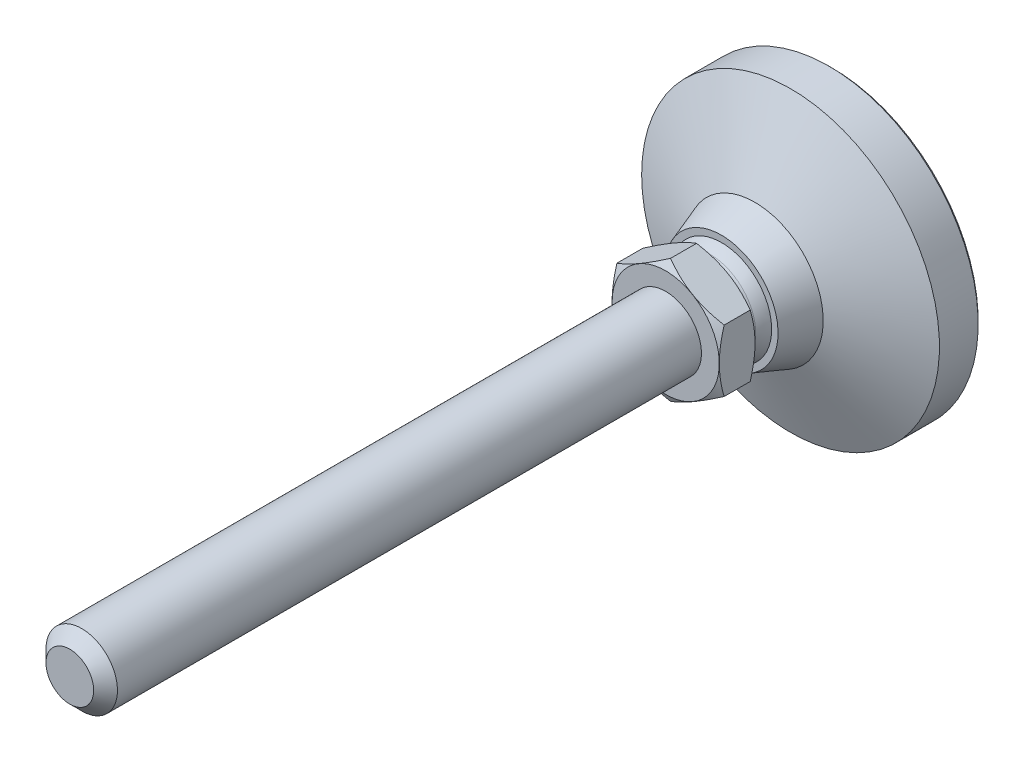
ISO-10303-21;
HEADER;
FILE_DESCRIPTION(('STEP AP214'),'2;1');
FILE_NAME('part.step','',(''),(''),'','','');
FILE_SCHEMA(('AUTOMOTIVE_DESIGN { 1 0 10303 214 1 1 1 1 }'));
ENDSEC;
DATA;
#1=APPLICATION_CONTEXT('core data for automotive mechanical design processes');
#2=APPLICATION_PROTOCOL_DEFINITION('international standard','automotive_design',2000,#1);
#3=PRODUCT_CONTEXT('',#1,'mechanical');
#4=PRODUCT('Part','Part','',(#3));
#5=PRODUCT_RELATED_PRODUCT_CATEGORY('part','',(#4));
#6=PRODUCT_DEFINITION_FORMATION('','',#4);
#7=PRODUCT_DEFINITION_CONTEXT('part definition',#1,'design');
#8=PRODUCT_DEFINITION('design','',#6,#7);
#9=PRODUCT_DEFINITION_SHAPE('','',#8);
#10=(LENGTH_UNIT() NAMED_UNIT(*) SI_UNIT(.MILLI.,.METRE.));
#11=(NAMED_UNIT(*) PLANE_ANGLE_UNIT() SI_UNIT($,.RADIAN.));
#12=(NAMED_UNIT(*) SI_UNIT($,.STERADIAN.) SOLID_ANGLE_UNIT());
#13=UNCERTAINTY_MEASURE_WITH_UNIT(LENGTH_MEASURE(1.E-05),#10,'distance_accuracy_value','');
#14=(GEOMETRIC_REPRESENTATION_CONTEXT(3) GLOBAL_UNCERTAINTY_ASSIGNED_CONTEXT((#13)) GLOBAL_UNIT_ASSIGNED_CONTEXT((#10,
#11,#12)) REPRESENTATION_CONTEXT('',''));
#15=CARTESIAN_POINT('',(0.,0.,0.));
#16=DIRECTION('',(0.,0.,1.));
#17=DIRECTION('',(1.,0.,0.));
#18=AXIS2_PLACEMENT_3D('',#15,#16,#17);
#19=CARTESIAN_POINT('',(0.,0.,22.7721236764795));
#20=DIRECTION('',(0.,0.,1.));
#21=DIRECTION('',(1.,0.,0.));
#22=AXIS2_PLACEMENT_3D('',#19,#20,#21);
#23=CONICAL_SURFACE('',#22,10.3923213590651,1.04719757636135);
#24=CARTESIAN_POINT('',(0.,0.,21.964430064));
#25=DIRECTION('',(0.,0.,-1.));
#26=DIRECTION('',(-1.,0.,0.));
#27=AXIS2_PLACEMENT_3D('',#24,#25,#26);
#28=CIRCLE('',#27,8.993354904);
#29=CARTESIAN_POINT('',(-8.993354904,0.,21.964430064));
#30=VERTEX_POINT('',#29);
#31=EDGE_CURVE('E258',#30,#30,#28,.T.);
#32=ORIENTED_EDGE('',*,*,#31,.F.);
#33=EDGE_LOOP('',(#32));
#34=FACE_BOUND('',#33,.T.);
#35=CARTESIAN_POINT('',(0.000199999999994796,10.3924203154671,22.7721808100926));
#36=CARTESIAN_POINT('',(-0.197607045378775,10.2782163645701,22.7062485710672));
#37=CARTESIAN_POINT('',(-0.396185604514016,10.163566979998,22.6433079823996));
#38=CARTESIAN_POINT('',(-0.794955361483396,9.93333715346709,22.5242355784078));
#39=CARTESIAN_POINT('',(-0.995147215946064,9.8177563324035,22.4681067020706));
#40=CARTESIAN_POINT('',(-1.39751504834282,9.58544915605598,22.3634185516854));
#41=CARTESIAN_POINT('',(-1.59969458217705,9.46872074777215,22.3148773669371));
#42=CARTESIAN_POINT('',(-2.00542874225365,9.2344700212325,22.2264151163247));
#43=CARTESIAN_POINT('',(-2.20898307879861,9.11694787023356,22.1864922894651));
#44=CARTESIAN_POINT('',(-2.61230588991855,8.88408933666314,22.1169512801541));
#45=CARTESIAN_POINT('',(-2.812044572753,8.76877015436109,22.0871041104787));
#46=CARTESIAN_POINT('',(-3.21241565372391,8.5376158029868,22.0370599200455));
#47=CARTESIAN_POINT('',(-3.4130479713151,8.42178068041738,22.0168620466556));
#48=CARTESIAN_POINT('',(-3.81466060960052,8.18990951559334,21.9866209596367));
#49=CARTESIAN_POINT('',(-4.01564027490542,8.07387385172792,21.9765662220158));
#50=CARTESIAN_POINT('',(-4.41778456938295,7.84169573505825,21.9668289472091));
#51=CARTESIAN_POINT('',(-4.618949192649,7.72555328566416,21.9671460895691));
#52=CARTESIAN_POINT('',(-4.99503258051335,7.50842144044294,21.9774305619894));
#53=CARTESIAN_POINT('',(-5.16997786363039,7.40741673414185,21.9861433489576));
#54=CARTESIAN_POINT('',(-5.5194586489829,7.20564390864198,22.0112439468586));
#55=CARTESIAN_POINT('',(-5.69399412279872,7.10487580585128,22.027632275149));
#56=CARTESIAN_POINT('',(-6.21692485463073,6.80296160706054,22.0879231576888));
#57=CARTESIAN_POINT('',(-6.56439449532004,6.60234991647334,22.1429440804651));
#58=CARTESIAN_POINT('',(-7.26301961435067,6.19899851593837,22.280497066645));
#59=CARTESIAN_POINT('',(-7.61408593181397,5.99631028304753,22.3636122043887));
#60=CARTESIAN_POINT('',(-8.31098329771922,5.59395640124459,22.5522491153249));
#61=CARTESIAN_POINT('',(-8.65682327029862,5.39428559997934,22.657726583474));
#62=CARTESIAN_POINT('',(-9.0002,5.1960369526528,22.7721808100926));
#63=B_SPLINE_CURVE_WITH_KNOTS('',3,(#35,#36,#37,#38,#39,#40,#41,#42,#43,#44,#45,#46,#47,#48,#49,
#50,#51,#52,#53,#54,#55,#56,#57,#58,#59,#60,#61,#62),.UNSPECIFIED.,.F.,.F.,(4,2,2,2,2,2,2,2,2,2,
2,2,2,4),(0.,0.713219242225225,1.42674512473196,2.14194695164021,2.85700250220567,
3.55449745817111,4.25193077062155,4.94857080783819,5.64518932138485,6.25162972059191,
6.85811100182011,8.07193744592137,9.31268389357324,10.5509947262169),.UNSPECIFIED.);
#64=CARTESIAN_POINT('',(0.,10.3923131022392,22.7721189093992));
#65=VERTEX_POINT('',#64);
#66=CARTESIAN_POINT('',(-9.00000715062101,5.1961565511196,22.7721189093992));
#67=VERTEX_POINT('',#66);
#68=EDGE_CURVE('E9',#65,#67,#63,.T.);
#69=ORIENTED_EDGE('',*,*,#68,.F.);
#70=CARTESIAN_POINT('',(9.0002,5.1960369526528,22.7721808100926));
#71=CARTESIAN_POINT('',(8.80239295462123,5.31024090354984,22.7062485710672));
#72=CARTESIAN_POINT('',(8.60381439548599,5.42489028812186,22.6433079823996));
#73=CARTESIAN_POINT('',(8.20504463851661,5.65512011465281,22.5242355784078));
#74=CARTESIAN_POINT('',(8.00485278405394,5.7707009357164,22.4681067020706));
#75=CARTESIAN_POINT('',(7.60248495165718,6.00300811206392,22.3634185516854));
#76=CARTESIAN_POINT('',(7.40030541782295,6.11973652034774,22.3148773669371));
#77=CARTESIAN_POINT('',(6.99457125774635,6.3539872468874,22.2264151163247));
#78=CARTESIAN_POINT('',(6.7910169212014,6.47150939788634,22.1864922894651));
#79=CARTESIAN_POINT('',(6.38769411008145,6.70436793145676,22.1169512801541));
#80=CARTESIAN_POINT('',(6.187955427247,6.81968711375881,22.0871041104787));
#81=CARTESIAN_POINT('',(5.78758434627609,7.0508414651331,22.0370599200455));
#82=CARTESIAN_POINT('',(5.5869520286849,7.16667658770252,22.0168620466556));
#83=CARTESIAN_POINT('',(5.18533939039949,7.39854775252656,21.9866209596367));
#84=CARTESIAN_POINT('',(4.98435972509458,7.51458341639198,21.9765662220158));
#85=CARTESIAN_POINT('',(4.58221543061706,7.74676153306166,21.9668289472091));
#86=CARTESIAN_POINT('',(4.381050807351,7.86290398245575,21.9671460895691));
#87=CARTESIAN_POINT('',(4.00496741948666,8.08003582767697,21.9774305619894));
#88=CARTESIAN_POINT('',(3.83002213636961,8.18104053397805,21.9861433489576));
#89=CARTESIAN_POINT('',(3.48054135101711,8.38281335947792,22.0112439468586));
#90=CARTESIAN_POINT('',(3.30600587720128,8.48358146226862,22.027632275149));
#91=CARTESIAN_POINT('',(2.78307514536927,8.78549566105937,22.0879231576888));
#92=CARTESIAN_POINT('',(2.43560550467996,8.98610735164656,22.1429440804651));
#93=CARTESIAN_POINT('',(1.73698038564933,9.38945875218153,22.280497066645));
#94=CARTESIAN_POINT('',(1.38591406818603,9.59214698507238,22.3636122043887));
#95=CARTESIAN_POINT('',(0.689016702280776,9.99450086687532,22.552249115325));
#96=CARTESIAN_POINT('',(0.343176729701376,10.1941716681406,22.657726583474));
#97=CARTESIAN_POINT('',(-0.000200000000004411,10.3924203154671,22.7721808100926));
#98=B_SPLINE_CURVE_WITH_KNOTS('',3,(#70,#71,#72,#73,#74,#75,#76,#77,#78,#79,#80,#81,#82,#83,#84,
#85,#86,#87,#88,#89,#90,#91,#92,#93,#94,#95,#96,#97),.UNSPECIFIED.,.F.,.F.,(4,2,2,2,2,2,2,2,2,2,
2,2,2,4),(0.,0.713219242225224,1.42674512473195,2.14194695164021,2.85700250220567,
3.55449745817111,4.25193077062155,4.94857080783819,5.64518932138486,6.25162972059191,
6.85811100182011,8.07193744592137,9.31268389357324,10.5509947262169),.UNSPECIFIED.);
#99=CARTESIAN_POINT('',(9.00000715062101,5.19615655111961,22.7721189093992));
#100=VERTEX_POINT('',#99);
#101=EDGE_CURVE('E70',#100,#65,#98,.T.);
#102=ORIENTED_EDGE('',*,*,#101,.F.);
#103=CARTESIAN_POINT('',(9.,-13.7804311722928,26.2747501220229));
#104=CARTESIAN_POINT('',(9.,-13.5828651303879,26.1792507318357));
#105=CARTESIAN_POINT('',(9.,-13.3850602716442,26.0842456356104));
#106=CARTESIAN_POINT('',(9.,-12.9889224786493,25.8953374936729));
#107=CARTESIAN_POINT('',(9.,-12.7905895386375,25.8014344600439));
#108=CARTESIAN_POINT('',(9.,-12.1946648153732,25.5215214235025));
#109=CARTESIAN_POINT('',(9.,-11.7962113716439,25.3373386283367));
#110=CARTESIAN_POINT('',(9.,-10.9942704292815,24.9739807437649));
#111=CARTESIAN_POINT('',(9.,-10.5907671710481,24.7948403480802));
#112=CARTESIAN_POINT('',(9.,-9.78044473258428,24.4442517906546));
#113=CARTESIAN_POINT('',(9.,-9.37362572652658,24.2728032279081));
#114=CARTESIAN_POINT('',(9.,-8.5509757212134,23.9376141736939));
#115=CARTESIAN_POINT('',(9.,-8.13509539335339,23.7739940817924));
#116=CARTESIAN_POINT('',(9.,-7.29843035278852,23.4595695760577));
#117=CARTESIAN_POINT('',(9.,-6.87764510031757,23.3087665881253));
#118=CARTESIAN_POINT('',(9.,-6.03135993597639,23.0240295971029));
#119=CARTESIAN_POINT('',(9.,-5.60587222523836,22.8900597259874));
#120=CARTESIAN_POINT('',(9.,-4.74886325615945,22.6433379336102));
#121=CARTESIAN_POINT('',(9.,-4.31734395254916,22.5305793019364));
#122=CARTESIAN_POINT('',(9.,-3.44790472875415,22.3317626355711));
#123=CARTESIAN_POINT('',(9.,-3.00998313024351,22.2457117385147));
#124=CARTESIAN_POINT('',(9.,-2.34924764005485,22.1409751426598));
#125=CARTESIAN_POINT('',(9.,-2.12833318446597,22.1101172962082));
#126=CARTESIAN_POINT('',(9.,-1.68546871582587,22.0571220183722));
#127=CARTESIAN_POINT('',(9.,-1.46351880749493,22.0349837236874));
#128=CARTESIAN_POINT('',(9.,-1.02029110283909,22.0000232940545));
#129=CARTESIAN_POINT('',(9.,-0.799017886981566,21.9871433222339));
#130=CARTESIAN_POINT('',(9.,-0.356124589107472,21.9707676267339));
#131=CARTESIAN_POINT('',(9.,-0.13450451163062,21.9672717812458));
#132=CARTESIAN_POINT('',(9.,0.308621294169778,21.9697476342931));
#133=CARTESIAN_POINT('',(9.,0.530127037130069,21.9757166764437));
#134=CARTESIAN_POINT('',(9.,0.972693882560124,21.9969738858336));
#135=CARTESIAN_POINT('',(9.,1.19375496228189,22.01226251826));
#136=CARTESIAN_POINT('',(9.,1.72955603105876,22.0602942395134));
#137=CARTESIAN_POINT('',(9.,2.04388419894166,22.09770773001));
#138=CARTESIAN_POINT('',(9.,2.67013150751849,22.1893002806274));
#139=CARTESIAN_POINT('',(9.,2.98204996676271,22.2434839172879));
#140=CARTESIAN_POINT('',(9.,3.60322064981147,22.3666950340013));
#141=CARTESIAN_POINT('',(9.,3.91247006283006,22.4357365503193));
#142=CARTESIAN_POINT('',(9.,4.52778698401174,22.5865569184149));
#143=CARTESIAN_POINT('',(9.,4.83385478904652,22.6683345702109));
#144=CARTESIAN_POINT('',(9.,5.45034614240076,22.8448082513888));
#145=CARTESIAN_POINT('',(9.,5.76069258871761,22.9397717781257));
#146=CARTESIAN_POINT('',(9.,6.37810510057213,23.1390806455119));
#147=CARTESIAN_POINT('',(9.,6.68517326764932,23.2434195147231));
#148=CARTESIAN_POINT('',(9.,7.29479705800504,23.4593239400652));
#149=CARTESIAN_POINT('',(9.,7.59736835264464,23.5708455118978));
#150=CARTESIAN_POINT('',(9.,8.20016350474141,23.8004336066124));
#151=CARTESIAN_POINT('',(9.,8.50038635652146,23.9185027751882));
#152=CARTESIAN_POINT('',(9.,8.79951858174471,24.0391980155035));
#153=B_SPLINE_CURVE_WITH_KNOTS('',3,(#103,#104,#105,#106,#107,#108,#109,#110,#111,#112,#113,
#114,#115,#116,#117,#118,#119,#120,#121,#122,#123,#124,#125,#126,#127,#128,#129,#130,#131,#132,
#133,#134,#135,#136,#137,#138,#139,#140,#141,#142,#143,#144,#145,#146,#147,#148,#149,#150,#151,
#152),.UNSPECIFIED.,.F.,.F.,(4,2,2,2,2,2,2,2,2,2,2,2,2,2,2,2,2,2,2,2,2,2,2,2,4),(0.,
0.658308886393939,1.31662498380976,2.63347134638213,3.95785441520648,5.28216835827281,
6.62273268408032,7.96344595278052,9.30125215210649,10.6386344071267,11.9763737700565,
12.6454062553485,13.3143724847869,13.9791224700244,14.6438638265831,15.3084186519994,
15.9730066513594,16.9221185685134,17.8714897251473,18.8217617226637,19.771944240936,
20.745415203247,21.7182193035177,22.6855475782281,23.6532696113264),.UNSPECIFIED.);
#154=CARTESIAN_POINT('',(9.00000715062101,-5.19615655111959,22.7721189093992));
#155=VERTEX_POINT('',#154);
#156=EDGE_CURVE('E75',#155,#100,#153,.T.);
#157=ORIENTED_EDGE('',*,*,#156,.F.);
#158=CARTESIAN_POINT('',(-0.000199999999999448,-10.3924203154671,22.7721808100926));
#159=CARTESIAN_POINT('',(0.197607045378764,-10.2782163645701,22.7062485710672));
#160=CARTESIAN_POINT('',(0.396185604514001,-10.163566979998,22.6433079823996));
#161=CARTESIAN_POINT('',(0.79495536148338,-9.93333715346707,22.5242355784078));
#162=CARTESIAN_POINT('',(0.995147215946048,-9.81775633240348,22.4681067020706));
#163=CARTESIAN_POINT('',(1.3975150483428,-9.58544915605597,22.3634185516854));
#164=CARTESIAN_POINT('',(1.59969458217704,-9.46872074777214,22.3148773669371));
#165=CARTESIAN_POINT('',(2.00542874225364,-9.23447002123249,22.2264151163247));
#166=CARTESIAN_POINT('',(2.20898307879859,-9.11694787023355,22.186492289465));
#167=CARTESIAN_POINT('',(2.61230588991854,-8.88408933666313,22.116951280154));
#168=CARTESIAN_POINT('',(2.81204457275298,-8.76877015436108,22.0871041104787));
#169=CARTESIAN_POINT('',(3.2124156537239,-8.53761580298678,22.0370599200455));
#170=CARTESIAN_POINT('',(3.41304797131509,-8.42178068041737,22.0168620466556));
#171=CARTESIAN_POINT('',(3.8146606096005,-8.18990951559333,21.9866209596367));
#172=CARTESIAN_POINT('',(4.0156402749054,-8.0738738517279,21.9765662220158));
#173=CARTESIAN_POINT('',(4.41778456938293,-7.84169573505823,21.9668289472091));
#174=CARTESIAN_POINT('',(4.61894919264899,-7.72555328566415,21.9671460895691));
#175=CARTESIAN_POINT('',(4.99503258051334,-7.50842144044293,21.9774305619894));
#176=CARTESIAN_POINT('',(5.16997786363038,-7.40741673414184,21.9861433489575));
#177=CARTESIAN_POINT('',(5.51945864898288,-7.20564390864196,22.0112439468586));
#178=CARTESIAN_POINT('',(5.69399412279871,-7.10487580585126,22.027632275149));
#179=CARTESIAN_POINT('',(6.21692485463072,-6.80296160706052,22.0879231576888));
#180=CARTESIAN_POINT('',(6.56439449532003,-6.60234991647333,22.142944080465));
#181=CARTESIAN_POINT('',(7.26301961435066,-6.19899851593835,22.280497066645));
#182=CARTESIAN_POINT('',(7.61408593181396,-5.9963102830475,22.3636122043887));
#183=CARTESIAN_POINT('',(8.31098329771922,-5.59395640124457,22.5522491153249));
#184=CARTESIAN_POINT('',(8.65682327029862,-5.39428559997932,22.657726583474));
#185=CARTESIAN_POINT('',(9.0002,-5.19603695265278,22.7721808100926));
#186=B_SPLINE_CURVE_WITH_KNOTS('',3,(#158,#159,#160,#161,#162,#163,#164,#165,#166,#167,#168,
#169,#170,#171,#172,#173,#174,#175,#176,#177,#178,#179,#180,#181,#182,#183,#184,#185),
.UNSPECIFIED.,.F.,.F.,(4,2,2,2,2,2,2,2,2,2,2,2,2,4),(0.,0.713219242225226,1.42674512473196,
2.14194695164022,2.85700250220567,3.55449745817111,4.25193077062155,4.94857080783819,
5.64518932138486,6.25162972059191,6.85811100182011,8.07193744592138,9.31268389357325,
10.5509947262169),.UNSPECIFIED.);
#187=CARTESIAN_POINT('',(0.,-10.3923131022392,22.7721189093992));
#188=VERTEX_POINT('',#187);
#189=EDGE_CURVE('E95',#188,#155,#186,.T.);
#190=ORIENTED_EDGE('',*,*,#189,.F.);
#191=CARTESIAN_POINT('',(-9.0002,-5.19603695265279,22.7721808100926));
#192=CARTESIAN_POINT('',(-8.80239295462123,-5.31024090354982,22.7062485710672));
#193=CARTESIAN_POINT('',(-8.60381439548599,-5.42489028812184,22.6433079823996));
#194=CARTESIAN_POINT('',(-8.20504463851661,-5.65512011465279,22.5242355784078));
#195=CARTESIAN_POINT('',(-8.00485278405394,-5.77070093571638,22.4681067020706));
#196=CARTESIAN_POINT('',(-7.60248495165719,-6.0030081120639,22.3634185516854));
#197=CARTESIAN_POINT('',(-7.40030541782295,-6.11973652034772,22.3148773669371));
#198=CARTESIAN_POINT('',(-6.99457125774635,-6.35398724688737,22.2264151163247));
#199=CARTESIAN_POINT('',(-6.7910169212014,-6.47150939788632,22.1864922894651));
#200=CARTESIAN_POINT('',(-6.38769411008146,-6.70436793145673,22.116951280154));
#201=CARTESIAN_POINT('',(-6.18795542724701,-6.81968711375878,22.0871041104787));
#202=CARTESIAN_POINT('',(-5.7875843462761,-7.05084146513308,22.0370599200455));
#203=CARTESIAN_POINT('',(-5.58695202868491,-7.16667658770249,22.0168620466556));
#204=CARTESIAN_POINT('',(-5.18533939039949,-7.39854775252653,21.9866209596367));
#205=CARTESIAN_POINT('',(-4.98435972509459,-7.51458341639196,21.9765662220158));
#206=CARTESIAN_POINT('',(-4.58221543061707,-7.74676153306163,21.9668289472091));
#207=CARTESIAN_POINT('',(-4.38105080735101,-7.86290398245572,21.9671460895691));
#208=CARTESIAN_POINT('',(-4.00496741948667,-8.08003582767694,21.9774305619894));
#209=CARTESIAN_POINT('',(-3.83002213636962,-8.18104053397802,21.9861433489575));
#210=CARTESIAN_POINT('',(-3.48054135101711,-8.3828133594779,22.0112439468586));
#211=CARTESIAN_POINT('',(-3.30600587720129,-8.4835814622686,22.027632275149));
#212=CARTESIAN_POINT('',(-2.78307514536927,-8.78549566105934,22.0879231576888));
#213=CARTESIAN_POINT('',(-2.43560550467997,-8.98610735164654,22.142944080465));
#214=CARTESIAN_POINT('',(-1.73698038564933,-9.38945875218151,22.280497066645));
#215=CARTESIAN_POINT('',(-1.38591406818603,-9.59214698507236,22.3636122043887));
#216=CARTESIAN_POINT('',(-0.689016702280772,-9.9945008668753,22.5522491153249));
#217=CARTESIAN_POINT('',(-0.343176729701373,-10.1941716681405,22.657726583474));
#218=CARTESIAN_POINT('',(0.00020000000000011,-10.3924203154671,22.7721808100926));
#219=B_SPLINE_CURVE_WITH_KNOTS('',3,(#191,#192,#193,#194,#195,#196,#197,#198,#199,#200,#201,
#202,#203,#204,#205,#206,#207,#208,#209,#210,#211,#212,#213,#214,#215,#216,#217,#218),
.UNSPECIFIED.,.F.,.F.,(4,2,2,2,2,2,2,2,2,2,2,2,2,4),(0.,0.713219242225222,1.42674512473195,
2.14194695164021,2.85700250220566,3.5544974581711,4.25193077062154,4.94857080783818,
5.64518932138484,6.2516297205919,6.8581110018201,8.07193744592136,9.31268389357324,
10.5509947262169),.UNSPECIFIED.);
#220=CARTESIAN_POINT('',(-9.00000715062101,-5.19615655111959,22.7721189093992));
#221=VERTEX_POINT('',#220);
#222=EDGE_CURVE('E90',#221,#188,#219,.T.);
#223=ORIENTED_EDGE('',*,*,#222,.F.);
#224=CARTESIAN_POINT('',(-9.,-13.7804311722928,26.274750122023));
#225=CARTESIAN_POINT('',(-9.,-13.5828651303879,26.1792507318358));
#226=CARTESIAN_POINT('',(-9.,-13.3850602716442,26.0842456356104));
#227=CARTESIAN_POINT('',(-9.,-12.9889224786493,25.8953374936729));
#228=CARTESIAN_POINT('',(-9.,-12.7905895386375,25.801434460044));
#229=CARTESIAN_POINT('',(-9.,-12.1946648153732,25.5215214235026));
#230=CARTESIAN_POINT('',(-9.,-11.7962113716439,25.3373386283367));
#231=CARTESIAN_POINT('',(-9.,-10.9942704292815,24.9739807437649));
#232=CARTESIAN_POINT('',(-9.,-10.5907671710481,24.7948403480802));
#233=CARTESIAN_POINT('',(-9.,-9.78044473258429,24.4442517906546));
#234=CARTESIAN_POINT('',(-9.,-9.3736257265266,24.2728032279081));
#235=CARTESIAN_POINT('',(-9.,-8.55097572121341,23.9376141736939));
#236=CARTESIAN_POINT('',(-9.,-8.1350953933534,23.7739940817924));
#237=CARTESIAN_POINT('',(-9.,-7.29843035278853,23.4595695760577));
#238=CARTESIAN_POINT('',(-9.,-6.87764510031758,23.3087665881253));
#239=CARTESIAN_POINT('',(-9.,-6.0313599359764,23.0240295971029));
#240=CARTESIAN_POINT('',(-9.,-5.60587222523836,22.8900597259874));
#241=CARTESIAN_POINT('',(-9.,-4.74886325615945,22.6433379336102));
#242=CARTESIAN_POINT('',(-9.,-4.31734395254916,22.5305793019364));
#243=CARTESIAN_POINT('',(-9.,-3.44790472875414,22.3317626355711));
#244=CARTESIAN_POINT('',(-9.,-3.00998313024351,22.2457117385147));
#245=CARTESIAN_POINT('',(-9.,-2.34924764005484,22.1409751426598));
#246=CARTESIAN_POINT('',(-9.,-2.12833318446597,22.1101172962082));
#247=CARTESIAN_POINT('',(-9.,-1.68546871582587,22.0571220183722));
#248=CARTESIAN_POINT('',(-9.,-1.46351880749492,22.0349837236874));
#249=CARTESIAN_POINT('',(-9.,-1.02029110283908,22.0000232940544));
#250=CARTESIAN_POINT('',(-9.,-0.799017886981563,21.9871433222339));
#251=CARTESIAN_POINT('',(-9.,-0.356124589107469,21.9707676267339));
#252=CARTESIAN_POINT('',(-9.,-0.134504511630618,21.9672717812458));
#253=CARTESIAN_POINT('',(-9.,0.308621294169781,21.9697476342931));
#254=CARTESIAN_POINT('',(-9.,0.530127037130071,21.9757166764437));
#255=CARTESIAN_POINT('',(-9.,0.972693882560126,21.9969738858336));
#256=CARTESIAN_POINT('',(-9.,1.19375496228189,22.01226251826));
#257=CARTESIAN_POINT('',(-9.,1.72955603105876,22.0602942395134));
#258=CARTESIAN_POINT('',(-9.,2.04388419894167,22.09770773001));
#259=CARTESIAN_POINT('',(-9.,2.6701315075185,22.1893002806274));
#260=CARTESIAN_POINT('',(-9.,2.98204996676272,22.2434839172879));
#261=CARTESIAN_POINT('',(-9.,3.60322064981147,22.3666950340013));
#262=CARTESIAN_POINT('',(-9.,3.91247006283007,22.4357365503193));
#263=CARTESIAN_POINT('',(-9.,4.52778698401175,22.5865569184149));
#264=CARTESIAN_POINT('',(-9.,4.83385478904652,22.6683345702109));
#265=CARTESIAN_POINT('',(-9.,5.45034614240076,22.8448082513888));
#266=CARTESIAN_POINT('',(-9.,5.76069258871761,22.9397717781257));
#267=CARTESIAN_POINT('',(-9.,6.37810510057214,23.1390806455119));
#268=CARTESIAN_POINT('',(-9.,6.68517326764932,23.2434195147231));
#269=CARTESIAN_POINT('',(-9.,7.29479705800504,23.4593239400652));
#270=CARTESIAN_POINT('',(-9.,7.59736835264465,23.5708455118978));
#271=CARTESIAN_POINT('',(-9.,8.20016350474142,23.8004336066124));
#272=CARTESIAN_POINT('',(-9.,8.50038635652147,23.9185027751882));
#273=CARTESIAN_POINT('',(-9.,8.79951858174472,24.0391980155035));
#274=B_SPLINE_CURVE_WITH_KNOTS('',3,(#224,#225,#226,#227,#228,#229,#230,#231,#232,#233,#234,
#235,#236,#237,#238,#239,#240,#241,#242,#243,#244,#245,#246,#247,#248,#249,#250,#251,#252,#253,
#254,#255,#256,#257,#258,#259,#260,#261,#262,#263,#264,#265,#266,#267,#268,#269,#270,#271,#272,
#273),.UNSPECIFIED.,.F.,.F.,(4,2,2,2,2,2,2,2,2,2,2,2,2,2,2,2,2,2,2,2,2,2,2,2,4),(0.,
0.658308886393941,1.31662498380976,2.63347134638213,3.95785441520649,5.28216835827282,
6.62273268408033,7.96344595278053,9.30125215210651,10.6386344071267,11.9763737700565,
12.6454062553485,13.3143724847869,13.9791224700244,14.6438638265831,15.3084186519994,
15.9730066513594,16.9221185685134,17.8714897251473,18.8217617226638,19.771944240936,
20.745415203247,21.7182193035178,22.6855475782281,23.6532696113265),.UNSPECIFIED.);
#275=EDGE_CURVE('E29',#67,#221,#274,.F.);
#276=ORIENTED_EDGE('',*,*,#275,.F.);
#277=EDGE_LOOP('',(#69,#102,#157,#190,#223,#276));
#278=FACE_BOUND('',#277,.T.);
#279=ADVANCED_FACE('F14',(#34,#278),#23,.T.);
#280=CARTESIAN_POINT('',(0.,6.27003726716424E-08,16.1837569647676));
#281=DIRECTION('',(0.,0.,-1.));
#282=DIRECTION('',(0.,-1.,0.));
#283=AXIS2_PLACEMENT_3D('',#280,#281,#282);
#284=SPHERICAL_SURFACE('',#283,8.75);
#285=CARTESIAN_POINT('',(0.,0.,18.5856706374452));
#286=DIRECTION('',(0.,0.,-1.));
#287=DIRECTION('',(-1.,0.,0.));
#288=AXIS2_PLACEMENT_3D('',#285,#286,#287);
#289=CIRCLE('',#288,8.41387601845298);
#290=CARTESIAN_POINT('',(0.,-8.41387601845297,18.5856706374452));
#291=VERTEX_POINT('',#290);
#292=EDGE_CURVE('E76',#291,#291,#289,.T.);
#293=CARTESIAN_POINT('',(0.,0.,20.4741046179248));
#294=DIRECTION('',(0.,0.,-1.));
#295=DIRECTION('',(-1.,0.,0.));
#296=AXIS2_PLACEMENT_3D('',#293,#294,#295);
#297=CIRCLE('',#296,7.62596984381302);
#298=CARTESIAN_POINT('',(0.,-7.62596984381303,20.4741046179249));
#299=VERTEX_POINT('',#298);
#300=EDGE_CURVE('E200',#299,#299,#297,.T.);
#301=CARTESIAN_POINT('',(0.,-8.41387601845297,18.5856706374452));
#302=CARTESIAN_POINT('',(0.,-8.40801162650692,18.6062135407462));
#303=CARTESIAN_POINT('',(0.,-8.40207199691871,18.6267349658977));
#304=CARTESIAN_POINT('',(0.,-8.390042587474,18.6677337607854));
#305=CARTESIAN_POINT('',(0.,-8.3839528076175,18.6882111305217));
#306=CARTESIAN_POINT('',(0.,-8.37162342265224,18.7291207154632));
#307=CARTESIAN_POINT('',(0.,-8.36538381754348,18.7495529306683));
#308=CARTESIAN_POINT('',(0.,-8.35275511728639,18.7903711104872));
#309=CARTESIAN_POINT('',(0.,-8.34636602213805,18.8107570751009));
#310=CARTESIAN_POINT('',(0.,-8.33343868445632,18.8514816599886));
#311=CARTESIAN_POINT('',(0.,-8.32690044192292,18.8718202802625));
#312=CARTESIAN_POINT('',(0.,-8.31367516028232,18.9124490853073));
#313=CARTESIAN_POINT('',(0.,-8.30698812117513,18.9327392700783));
#314=CARTESIAN_POINT('',(0.,-8.29346560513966,18.9732701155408));
#315=CARTESIAN_POINT('',(0.,-8.2866301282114,18.9935107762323));
#316=CARTESIAN_POINT('',(0.,-8.27281110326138,19.0339414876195));
#317=CARTESIAN_POINT('',(0.,-8.26582755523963,19.0541315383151));
#318=CARTESIAN_POINT('',(0.,-8.2517127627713,19.0944599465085));
#319=CARTESIAN_POINT('',(0.,-8.24458151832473,19.1145983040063));
#320=CARTESIAN_POINT('',(0.,-8.23017171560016,19.1548222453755));
#321=CARTESIAN_POINT('',(0.,-8.22289315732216,19.174907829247));
#322=CARTESIAN_POINT('',(0.,-8.20818911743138,19.2150251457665));
#323=CARTESIAN_POINT('',(0.,-8.20076363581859,19.2350568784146));
#324=CARTESIAN_POINT('',(0.,-8.18576614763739,19.2750654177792));
#325=CARTESIAN_POINT('',(0.,-8.17819414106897,19.2950422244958));
#326=CARTESIAN_POINT('',(0.,-8.16290400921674,19.3349398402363));
#327=CARTESIAN_POINT('',(0.,-8.15518588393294,19.3548606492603));
#328=CARTESIAN_POINT('',(0.,-8.1396039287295,19.3946452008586));
#329=CARTESIAN_POINT('',(0.,-8.13174009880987,19.4145089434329));
#330=CARTESIAN_POINT('',(0.,-8.11586715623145,19.4541782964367));
#331=CARTESIAN_POINT('',(0.,-8.10785804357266,19.4739839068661));
#332=CARTESIAN_POINT('',(0.,-8.09169496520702,19.5135359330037));
#333=CARTESIAN_POINT('',(0.,-8.08354099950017,19.5332823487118));
#334=CARTESIAN_POINT('',(0.,-8.06708865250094,19.5727149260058));
#335=CARTESIAN_POINT('',(0.,-8.05879027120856,19.5924010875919));
#336=CARTESIAN_POINT('',(0.,-8.04204953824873,19.6317121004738));
#337=CARTESIAN_POINT('',(0.,-8.03360718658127,19.6513369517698));
#338=CARTESIAN_POINT('',(0.,-8.0165789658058,19.6905242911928));
#339=CARTESIAN_POINT('',(0.,-8.00799309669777,19.71008677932));
#340=CARTESIAN_POINT('',(0.,-7.99067830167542,19.7491483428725));
#341=CARTESIAN_POINT('',(0.,-7.98194937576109,19.768647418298));
#342=CARTESIAN_POINT('',(0.,-7.96434893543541,19.8075811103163));
#343=CARTESIAN_POINT('',(0.,-7.95547742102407,19.8270157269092));
#344=CARTESIAN_POINT('',(0.,-7.93759227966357,19.86581945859));
#345=CARTESIAN_POINT('',(0.,-7.92857865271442,19.8851885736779));
#346=CARTESIAN_POINT('',(0.,-7.9104097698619,19.9238602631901));
#347=CARTESIAN_POINT('',(0.,-7.90125451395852,19.9431628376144));
#348=CARTESIAN_POINT('',(0.,-7.88280286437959,19.9817004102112));
#349=CARTESIAN_POINT('',(0.,-7.87350647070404,20.0009354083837));
#350=CARTESIAN_POINT('',(0.,-7.85477304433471,20.0393367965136));
#351=CARTESIAN_POINT('',(0.,-7.84533601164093,20.058503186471));
#352=CARTESIAN_POINT('',(0.,-7.82632181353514,20.0967663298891));
#353=CARTESIAN_POINT('',(0.,-7.81674464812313,20.1158630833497));
#354=CARTESIAN_POINT('',(0.,-7.79745069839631,20.1539859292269));
#355=CARTESIAN_POINT('',(0.,-7.78773391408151,20.1730120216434));
#356=CARTESIAN_POINT('',(0.,-7.76816124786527,20.2109925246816));
#357=CARTESIAN_POINT('',(0.,-7.75830536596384,20.2299469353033));
#358=CARTESIAN_POINT('',(0.,-7.73845503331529,20.267783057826));
#359=CARTESIAN_POINT('',(0.,-7.72846058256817,20.2866647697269));
#360=CARTESIAN_POINT('',(0.,-7.70833364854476,20.3243544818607));
#361=CARTESIAN_POINT('',(0.,-7.69820116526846,20.3431624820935));
#362=CARTESIAN_POINT('',(0.,-7.67779870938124,20.3807037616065));
#363=CARTESIAN_POINT('',(0.,-7.66752873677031,20.3994370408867));
#364=CARTESIAN_POINT('',(0.,-7.64685185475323,20.4368278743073));
#365=CARTESIAN_POINT('',(0.,-7.63644494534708,20.4554854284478));
#366=CARTESIAN_POINT('',(0.,-7.62596984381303,20.4741046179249));
#367=B_SPLINE_CURVE_WITH_KNOTS('',3,(#301,#302,#303,#304,#305,#306,#307,#308,#309,#310,#311,
#312,#313,#314,#315,#316,#317,#318,#319,#320,#321,#322,#323,#324,#325,#326,#327,#328,#329,#330,
#331,#332,#333,#334,#335,#336,#337,#338,#339,#340,#341,#342,#343,#344,#345,#346,#347,#348,#349,
#350,#351,#352,#353,#354,#355,#356,#357,#358,#359,#360,#361,#362,#363,#364,#365,#366),
.UNSPECIFIED.,.F.,.F.,(4,2,2,2,2,2,2,2,2,2,2,2,2,2,2,2,2,2,2,2,2,2,2,2,2,2,2,2,2,2,2,2,4),(0.,
0.0640905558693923,0.128181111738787,0.192271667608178,0.256362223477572,0.320452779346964,
0.384543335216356,0.44863389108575,0.512724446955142,0.576815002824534,0.640905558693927,
0.704996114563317,0.769086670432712,0.833177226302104,0.897267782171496,0.961358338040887,
1.02544889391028,1.08953944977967,1.15363000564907,1.21772056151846,1.28181111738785,
1.34590167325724,1.40999222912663,1.47408278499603,1.53817334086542,1.60226389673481,
1.6663544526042,1.7304450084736,1.79453556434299,1.85862612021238,1.92271667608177,
1.98680723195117,2.05089778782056),.UNSPECIFIED.);
#368=EDGE_CURVE('BSEAM16',#291,#299,#367,.T.);
#369=ORIENTED_EDGE('',*,*,#292,.F.);
#370=ORIENTED_EDGE('',*,*,#300,.T.);
#371=ORIENTED_EDGE('',*,*,#368,.T.);
#372=ORIENTED_EDGE('',*,*,#368,.F.);
#373=EDGE_LOOP('',(#369,#371,#370,#372));
#374=FACE_BOUND('',#373,.T.);
#375=ADVANCED_FACE('F16',(#374),#284,.T.);
#376=CARTESIAN_POINT('',(0.,0.,18.5856706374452));
#377=DIRECTION('',(0.,0.,1.));
#378=DIRECTION('',(1.,0.,0.));
#379=AXIS2_PLACEMENT_3D('',#376,#377,#378);
#380=CONICAL_SURFACE('',#379,8.41387601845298,1.56130196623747);
#381=CARTESIAN_POINT('',(0.,0.,18.5959829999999));
#382=DIRECTION('',(0.,0.,-1.));
#383=DIRECTION('',(-1.,0.,0.));
#384=AXIS2_PLACEMENT_3D('',#381,#382,#383);
#385=CIRCLE('',#384,9.5000000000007);
#386=CARTESIAN_POINT('',(-9.5000000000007,0.,18.5959829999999));
#387=VERTEX_POINT('',#386);
#388=EDGE_CURVE('E284',#387,#387,#385,.T.);
#389=ORIENTED_EDGE('',*,*,#388,.F.);
#390=EDGE_LOOP('',(#389));
#391=FACE_BOUND('',#390,.T.);
#392=ORIENTED_EDGE('',*,*,#292,.T.);
#393=EDGE_LOOP('',(#392));
#394=FACE_BOUND('',#393,.T.);
#395=ADVANCED_FACE('F290',(#391,#394),#380,.F.);
#396=CARTESIAN_POINT('',(0.,0.,18.5959829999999));
#397=DIRECTION('',(0.,0.,-1.));
#398=DIRECTION('',(-1.,0.,0.));
#399=AXIS2_PLACEMENT_3D('',#396,#397,#398);
#400=CONICAL_SURFACE('',#399,9.5000000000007,0.341083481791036);
#401=CARTESIAN_POINT('',(0.,0.,13.));
#402=DIRECTION('',(0.,0.,-1.));
#403=DIRECTION('',(-1.,0.,0.));
#404=AXIS2_PLACEMENT_3D('',#401,#402,#403);
#405=CIRCLE('',#404,11.4863300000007);
#406=CARTESIAN_POINT('',(-11.4863300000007,0.,13.));
#407=VERTEX_POINT('',#406);
#408=EDGE_CURVE('E281',#407,#407,#405,.T.);
#409=ORIENTED_EDGE('',*,*,#408,.F.);
#410=EDGE_LOOP('',(#409));
#411=FACE_BOUND('',#410,.T.);
#412=ORIENTED_EDGE('',*,*,#388,.T.);
#413=EDGE_LOOP('',(#412));
#414=FACE_BOUND('',#413,.T.);
#415=ADVANCED_FACE('F329',(#411,#414),#400,.T.);
#416=CARTESIAN_POINT('',(0.,0.,13.));
#417=DIRECTION('',(0.,0.,-1.));
#418=DIRECTION('',(-1.,0.,0.));
#419=AXIS2_PLACEMENT_3D('',#416,#417,#418);
#420=CONICAL_SURFACE('',#419,11.4863300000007,1.15294748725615);
#421=CARTESIAN_POINT('',(0.,0.,7.));
#422=DIRECTION('',(0.,0.,-1.));
#423=DIRECTION('',(-1.,0.,0.));
#424=AXIS2_PLACEMENT_3D('',#421,#422,#423);
#425=CIRCLE('',#424,25.0000000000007);
#426=CARTESIAN_POINT('',(-25.0000000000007,0.,7.));
#427=VERTEX_POINT('',#426);
#428=EDGE_CURVE('E278',#427,#427,#425,.T.);
#429=ORIENTED_EDGE('',*,*,#428,.F.);
#430=EDGE_LOOP('',(#429));
#431=FACE_BOUND('',#430,.T.);
#432=ORIENTED_EDGE('',*,*,#408,.T.);
#433=EDGE_LOOP('',(#432));
#434=FACE_BOUND('',#433,.T.);
#435=ADVANCED_FACE('F325',(#431,#434),#420,.T.);
#436=CARTESIAN_POINT('',(0.,0.,0.));
#437=DIRECTION('',(0.,0.,-1.));
#438=DIRECTION('',(-1.,0.,0.));
#439=AXIS2_PLACEMENT_3D('',#436,#437,#438);
#440=CYLINDRICAL_SURFACE('',#439,25.0000000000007);
#441=CARTESIAN_POINT('',(0.,0.,0.499999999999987));
#442=DIRECTION('',(0.,0.,-1.));
#443=DIRECTION('',(-1.,0.,0.));
#444=AXIS2_PLACEMENT_3D('',#441,#442,#443);
#445=CIRCLE('',#444,25.0000000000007);
#446=CARTESIAN_POINT('',(-25.0000000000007,0.,0.499999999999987));
#447=VERTEX_POINT('',#446);
#448=EDGE_CURVE('E275',#447,#447,#445,.T.);
#449=ORIENTED_EDGE('',*,*,#448,.F.);
#450=EDGE_LOOP('',(#449));
#451=FACE_BOUND('',#450,.T.);
#452=ORIENTED_EDGE('',*,*,#428,.T.);
#453=EDGE_LOOP('',(#452));
#454=FACE_BOUND('',#453,.T.);
#455=ADVANCED_FACE('F317',(#451,#454),#440,.T.);
#456=CARTESIAN_POINT('',(0.,0.,0.499999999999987));
#457=DIRECTION('',(0.,0.,1.));
#458=DIRECTION('',(1.,0.,0.));
#459=AXIS2_PLACEMENT_3D('',#456,#457,#458);
#460=CONICAL_SURFACE('',#459,25.0000000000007,0.785398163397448);
#461=CARTESIAN_POINT('',(0.,0.,0.));
#462=DIRECTION('',(0.,0.,-1.));
#463=DIRECTION('',(-1.,0.,0.));
#464=AXIS2_PLACEMENT_3D('',#461,#462,#463);
#465=CIRCLE('',#464,24.5000000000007);
#466=CARTESIAN_POINT('',(-24.5000000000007,0.,0.));
#467=VERTEX_POINT('',#466);
#468=EDGE_CURVE('E272',#467,#467,#465,.T.);
#469=ORIENTED_EDGE('',*,*,#468,.F.);
#470=EDGE_LOOP('',(#469));
#471=FACE_BOUND('',#470,.T.);
#472=ORIENTED_EDGE('',*,*,#448,.T.);
#473=EDGE_LOOP('',(#472));
#474=FACE_BOUND('',#473,.T.);
#475=ADVANCED_FACE('F310',(#471,#474),#460,.T.);
#476=CARTESIAN_POINT('',(0.,0.,0.));
#477=DIRECTION('',(0.,0.,1.));
#478=DIRECTION('',(1.,0.,0.));
#479=AXIS2_PLACEMENT_3D('',#476,#477,#478);
#480=PLANE('',#479);
#481=ORIENTED_EDGE('',*,*,#468,.T.);
#482=EDGE_LOOP('',(#481));
#483=FACE_BOUND('',#482,.T.);
#484=ADVANCED_FACE('F303',(#483),#480,.F.);
#485=CARTESIAN_POINT('',(0.,-8.993354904,21.964430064));
#486=DIRECTION('',(0.,0.,1.));
#487=DIRECTION('',(1.,0.,0.));
#488=AXIS2_PLACEMENT_3D('',#485,#486,#487);
#489=PLANE('',#488);
#490=CARTESIAN_POINT('',(0.,0.,21.964430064));
#491=DIRECTION('',(0.,0.,-1.));
#492=DIRECTION('',(-1.,0.,0.));
#493=AXIS2_PLACEMENT_3D('',#490,#491,#492);
#494=CIRCLE('',#493,8.49750926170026);
#495=CARTESIAN_POINT('',(-8.49750926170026,0.,21.964430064));
#496=VERTEX_POINT('',#495);
#497=EDGE_CURVE('E264',#496,#496,#494,.T.);
#498=ORIENTED_EDGE('',*,*,#497,.F.);
#499=EDGE_LOOP('',(#498));
#500=FACE_BOUND('',#499,.T.);
#501=ORIENTED_EDGE('',*,*,#31,.T.);
#502=EDGE_LOOP('',(#501));
#503=FACE_BOUND('',#502,.T.);
#504=ADVANCED_FACE('F118',(#500,#503),#489,.F.);
#505=CARTESIAN_POINT('',(0.,0.,20.964430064));
#506=DIRECTION('',(0.,0.,-1.));
#507=DIRECTION('',(-1.,0.,0.));
#508=AXIS2_PLACEMENT_3D('',#505,#506,#507);
#509=TOROIDAL_SURFACE('',#508,8.49750926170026,1.);
#510=ORIENTED_EDGE('',*,*,#300,.F.);
#511=EDGE_LOOP('',(#510));
#512=FACE_BOUND('',#511,.T.);
#513=ORIENTED_EDGE('',*,*,#497,.T.);
#514=EDGE_LOOP('',(#513));
#515=FACE_BOUND('',#514,.T.);
#516=ADVANCED_FACE('F210',(#512,#515),#509,.F.);
#517=CARTESIAN_POINT('',(0.,10.3923048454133,-5.53102410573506));
#518=DIRECTION('',(-0.5,0.866025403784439,0.));
#519=DIRECTION('',(-0.866025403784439,-0.5,0.));
#520=AXIS2_PLACEMENT_3D('',#517,#518,#519);
#521=PLANE('',#520);
#522=CARTESIAN_POINT('',(-9.0002,5.1960369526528,27.1522492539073));
#523=CARTESIAN_POINT('',(-8.80239295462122,5.31024090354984,27.2181814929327));
#524=CARTESIAN_POINT('',(-8.60381439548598,5.42489028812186,27.2811220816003));
#525=CARTESIAN_POINT('',(-8.2050446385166,5.65512011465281,27.4001944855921));
#526=CARTESIAN_POINT('',(-8.00485278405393,5.7707009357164,27.4563233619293));
#527=CARTESIAN_POINT('',(-7.60248495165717,6.00300811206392,27.5610115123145));
#528=CARTESIAN_POINT('',(-7.40030541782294,6.11973652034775,27.6095526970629));
#529=CARTESIAN_POINT('',(-6.99457125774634,6.3539872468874,27.6980149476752));
#530=CARTESIAN_POINT('',(-6.79101692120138,6.47150939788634,27.7379377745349));
#531=CARTESIAN_POINT('',(-6.38769411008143,6.70436793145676,27.8074787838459));
#532=CARTESIAN_POINT('',(-6.18795542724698,6.81968711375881,27.8373259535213));
#533=CARTESIAN_POINT('',(-5.78758434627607,7.05084146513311,27.8873701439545));
#534=CARTESIAN_POINT('',(-5.58695202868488,7.16667658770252,27.9075680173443));
#535=CARTESIAN_POINT('',(-5.18533939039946,7.39854775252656,27.9378091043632));
#536=CARTESIAN_POINT('',(-4.98435972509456,7.51458341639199,27.9478638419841));
#537=CARTESIAN_POINT('',(-4.58221543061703,7.74676153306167,27.9576011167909));
#538=CARTESIAN_POINT('',(-4.38105080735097,7.86290398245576,27.9572839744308));
#539=CARTESIAN_POINT('',(-4.00496741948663,8.08003582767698,27.9469995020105));
#540=CARTESIAN_POINT('',(-3.83002213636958,8.18104053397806,27.9382867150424));
#541=CARTESIAN_POINT('',(-3.48054135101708,8.38281335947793,27.9131861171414));
#542=CARTESIAN_POINT('',(-3.30600587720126,8.48358146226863,27.8967977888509));
#543=CARTESIAN_POINT('',(-2.78307514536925,8.78549566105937,27.8365069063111));
#544=CARTESIAN_POINT('',(-2.43560550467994,8.98610735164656,27.7814859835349));
#545=CARTESIAN_POINT('',(-1.73698038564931,9.38945875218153,27.6439329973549));
#546=CARTESIAN_POINT('',(-1.38591406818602,9.59214698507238,27.5608178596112));
#547=CARTESIAN_POINT('',(-0.689016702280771,9.99450086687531,27.372180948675));
#548=CARTESIAN_POINT('',(-0.343176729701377,10.1941716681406,27.2667034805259));
#549=CARTESIAN_POINT('',(0.000199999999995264,10.3924203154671,27.1522492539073));
#550=B_SPLINE_CURVE_WITH_KNOTS('',3,(#522,#523,#524,#525,#526,#527,#528,#529,#530,#531,#532,
#533,#534,#535,#536,#537,#538,#539,#540,#541,#542,#543,#544,#545,#546,#547,#548,#549),
.UNSPECIFIED.,.F.,.F.,(4,2,2,2,2,2,2,2,2,2,2,2,2,4),(0.,0.713219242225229,1.42674512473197,
2.14194695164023,2.85700250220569,3.55449745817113,4.25193077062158,4.94857080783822,
5.64518932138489,6.25162972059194,6.85811100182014,8.07193744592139,9.31268389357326,
10.5509947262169),.UNSPECIFIED.);
#551=CARTESIAN_POINT('',(-9.000007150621,5.1961565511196,27.1523111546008));
#552=VERTEX_POINT('',#551);
#553=CARTESIAN_POINT('',(0.,10.3923131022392,27.1523111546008));
#554=VERTEX_POINT('',#553);
#555=EDGE_CURVE('E83',#552,#554,#550,.T.);
#556=ORIENTED_EDGE('',*,*,#555,.T.);
#557=DIRECTION('',(0.,0.,1.));
#558=VECTOR('',#557,1.);
#559=CARTESIAN_POINT('',(0.,10.3923048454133,-5.53102410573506));
#560=LINE('',#559,#558);
#561=EDGE_CURVE('E36',#65,#554,#560,.T.);
#562=ORIENTED_EDGE('',*,*,#561,.F.);
#563=ORIENTED_EDGE('',*,*,#68,.T.);
#564=DIRECTION('',(0.,0.,1.));
#565=VECTOR('',#564,1.);
#566=CARTESIAN_POINT('',(-9.,5.19615242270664,-5.53102410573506));
#567=LINE('',#566,#565);
#568=EDGE_CURVE('E85',#67,#552,#567,.T.);
#569=ORIENTED_EDGE('',*,*,#568,.T.);
#570=EDGE_LOOP('',(#556,#562,#563,#569));
#571=FACE_BOUND('',#570,.T.);
#572=ADVANCED_FACE('F79',(#571),#521,.T.);
#573=CARTESIAN_POINT('',(-9.,5.19615242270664,-5.53102410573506));
#574=DIRECTION('',(-1.,0.,0.));
#575=DIRECTION('',(0.,-1.,0.));
#576=AXIS2_PLACEMENT_3D('',#573,#574,#575);
#577=PLANE('',#576);
#578=CARTESIAN_POINT('',(-9.,-13.7804311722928,23.6496799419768));
#579=CARTESIAN_POINT('',(-9.,-13.5828651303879,23.745179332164));
#580=CARTESIAN_POINT('',(-9.,-13.3850602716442,23.8401844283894));
#581=CARTESIAN_POINT('',(-9.,-12.9889224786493,24.0290925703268));
#582=CARTESIAN_POINT('',(-9.,-12.7905895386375,24.1229956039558));
#583=CARTESIAN_POINT('',(-9.,-12.1946648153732,24.4029086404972));
#584=CARTESIAN_POINT('',(-9.,-11.7962113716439,24.5870914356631));
#585=CARTESIAN_POINT('',(-9.,-10.9942704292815,24.9504493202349));
#586=CARTESIAN_POINT('',(-9.,-10.5907671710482,25.1295897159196));
#587=CARTESIAN_POINT('',(-9.,-9.78044473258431,25.4801782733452));
#588=CARTESIAN_POINT('',(-9.,-9.37362572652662,25.6516268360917));
#589=CARTESIAN_POINT('',(-9.,-8.55097572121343,25.986815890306));
#590=CARTESIAN_POINT('',(-9.,-8.13509539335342,26.1504359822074));
#591=CARTESIAN_POINT('',(-9.,-7.29843035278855,26.4648604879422));
#592=CARTESIAN_POINT('',(-9.,-6.87764510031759,26.6156634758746));
#593=CARTESIAN_POINT('',(-9.,-6.03135993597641,26.900400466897));
#594=CARTESIAN_POINT('',(-9.,-5.60587222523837,27.0343703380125));
#595=CARTESIAN_POINT('',(-9.,-4.74886325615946,27.2810921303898));
#596=CARTESIAN_POINT('',(-9.,-4.31734395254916,27.3938507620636));
#597=CARTESIAN_POINT('',(-9.,-3.44790472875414,27.5926674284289));
#598=CARTESIAN_POINT('',(-9.,-3.0099831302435,27.6787183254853));
#599=CARTESIAN_POINT('',(-9.,-2.34924764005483,27.7834549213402));
#600=CARTESIAN_POINT('',(-9.,-2.12833318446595,27.8143127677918));
#601=CARTESIAN_POINT('',(-9.,-1.68546871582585,27.8673080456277));
#602=CARTESIAN_POINT('',(-9.,-1.4635188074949,27.8894463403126));
#603=CARTESIAN_POINT('',(-9.,-1.02029110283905,27.9244067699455));
#604=CARTESIAN_POINT('',(-9.,-0.799017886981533,27.937286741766));
#605=CARTESIAN_POINT('',(-9.,-0.356124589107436,27.9536624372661));
#606=CARTESIAN_POINT('',(-9.,-0.134504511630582,27.9571582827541));
#607=CARTESIAN_POINT('',(-9.,0.308621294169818,27.9546824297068));
#608=CARTESIAN_POINT('',(-9.,0.530127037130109,27.9487133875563));
#609=CARTESIAN_POINT('',(-9.,0.972693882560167,27.9274561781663));
#610=CARTESIAN_POINT('',(-9.,1.19375496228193,27.91216754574));
#611=CARTESIAN_POINT('',(-9.,1.72955603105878,27.8641358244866));
#612=CARTESIAN_POINT('',(-9.,2.04388419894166,27.82672233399));
#613=CARTESIAN_POINT('',(-9.,2.67013150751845,27.7351297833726));
#614=CARTESIAN_POINT('',(-9.,2.98204996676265,27.680946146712));
#615=CARTESIAN_POINT('',(-9.,3.60322064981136,27.5577350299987));
#616=CARTESIAN_POINT('',(-9.,3.91247006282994,27.4886935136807));
#617=CARTESIAN_POINT('',(-9.,4.52778698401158,27.3378731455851));
#618=CARTESIAN_POINT('',(-9.,4.83385478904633,27.2560954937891));
#619=CARTESIAN_POINT('',(-9.,5.45034614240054,27.0796218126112));
#620=CARTESIAN_POINT('',(-9.,5.76069258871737,26.9846582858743));
#621=CARTESIAN_POINT('',(-9.,6.37810510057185,26.7853494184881));
#622=CARTESIAN_POINT('',(-9.,6.68517326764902,26.6810105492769));
#623=CARTESIAN_POINT('',(-9.,7.2947970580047,26.4651061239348));
#624=CARTESIAN_POINT('',(-9.,7.59736835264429,26.3535845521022));
#625=CARTESIAN_POINT('',(-9.,8.20016350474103,26.1239964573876));
#626=CARTESIAN_POINT('',(-9.,8.50038635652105,26.0059272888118));
#627=CARTESIAN_POINT('',(-9.,8.79951858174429,25.8852320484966));
#628=B_SPLINE_CURVE_WITH_KNOTS('',3,(#578,#579,#580,#581,#582,#583,#584,#585,#586,#587,#588,
#589,#590,#591,#592,#593,#594,#595,#596,#597,#598,#599,#600,#601,#602,#603,#604,#605,#606,#607,
#608,#609,#610,#611,#612,#613,#614,#615,#616,#617,#618,#619,#620,#621,#622,#623,#624,#625,#626,
#627),.UNSPECIFIED.,.F.,.F.,(4,2,2,2,2,2,2,2,2,2,2,2,2,2,2,2,2,2,2,2,2,2,2,2,4),(0.,
0.658308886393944,1.31662498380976,2.63347134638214,3.9578544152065,5.28216835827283,
6.62273268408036,7.96344595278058,9.30125215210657,10.6386344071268,11.9763737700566,
12.6454062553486,13.314372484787,13.9791224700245,14.6438638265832,15.3084186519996,
15.9730066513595,16.9221185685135,17.8714897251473,18.8217617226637,19.7719442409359,
20.7454152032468,21.7182193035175,22.6855475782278,23.6532696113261),.UNSPECIFIED.);
#629=CARTESIAN_POINT('',(-9.000007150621,-5.19615655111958,27.1523111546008));
#630=VERTEX_POINT('',#629);
#631=EDGE_CURVE('E191',#630,#552,#628,.T.);
#632=ORIENTED_EDGE('',*,*,#631,.T.);
#633=ORIENTED_EDGE('',*,*,#568,.F.);
#634=ORIENTED_EDGE('',*,*,#275,.T.);
#635=DIRECTION('',(0.,0.,1.));
#636=VECTOR('',#635,1.);
#637=CARTESIAN_POINT('',(-9.,-5.19615242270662,-5.53102410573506));
#638=LINE('',#637,#636);
#639=EDGE_CURVE('E170',#221,#630,#638,.T.);
#640=ORIENTED_EDGE('',*,*,#639,.T.);
#641=EDGE_LOOP('',(#632,#633,#634,#640));
#642=FACE_BOUND('',#641,.T.);
#643=ADVANCED_FACE('F111',(#642),#577,.T.);
#644=CARTESIAN_POINT('',(-9.,-5.19615242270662,-5.53102410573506));
#645=DIRECTION('',(-0.5,-0.866025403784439,0.));
#646=DIRECTION('',(0.866025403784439,-0.5,0.));
#647=AXIS2_PLACEMENT_3D('',#644,#645,#646);
#648=PLANE('',#647);
#649=CARTESIAN_POINT('',(0.000200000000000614,-10.3924203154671,27.1522492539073));
#650=CARTESIAN_POINT('',(-0.197607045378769,-10.2782163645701,27.2181814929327));
#651=CARTESIAN_POINT('',(-0.396185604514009,-10.163566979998,27.2811220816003));
#652=CARTESIAN_POINT('',(-0.79495536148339,-9.93333715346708,27.4001944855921));
#653=CARTESIAN_POINT('',(-0.995147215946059,-9.81775633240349,27.4563233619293));
#654=CARTESIAN_POINT('',(-1.39751504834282,-9.58544915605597,27.5610115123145));
#655=CARTESIAN_POINT('',(-1.59969458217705,-9.46872074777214,27.6095526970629));
#656=CARTESIAN_POINT('',(-2.00542874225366,-9.23447002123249,27.6980149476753));
#657=CARTESIAN_POINT('',(-2.20898307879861,-9.11694787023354,27.7379377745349));
#658=CARTESIAN_POINT('',(-2.61230588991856,-8.88408933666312,27.8074787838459));
#659=CARTESIAN_POINT('',(-2.81204457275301,-8.76877015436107,27.8373259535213));
#660=CARTESIAN_POINT('',(-3.21241565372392,-8.53761580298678,27.8873701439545));
#661=CARTESIAN_POINT('',(-3.41304797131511,-8.42178068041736,27.9075680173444));
#662=CARTESIAN_POINT('',(-3.81466060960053,-8.18990951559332,27.9378091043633));
#663=CARTESIAN_POINT('',(-4.01564027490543,-8.07387385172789,27.9478638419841));
#664=CARTESIAN_POINT('',(-4.41778456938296,-7.84169573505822,27.9576011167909));
#665=CARTESIAN_POINT('',(-4.61894919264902,-7.72555328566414,27.9572839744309));
#666=CARTESIAN_POINT('',(-4.99503258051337,-7.50842144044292,27.9469995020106));
#667=CARTESIAN_POINT('',(-5.16997786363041,-7.40741673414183,27.9382867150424));
#668=CARTESIAN_POINT('',(-5.51945864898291,-7.20564390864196,27.9131861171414));
#669=CARTESIAN_POINT('',(-5.69399412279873,-7.10487580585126,27.8967977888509));
#670=CARTESIAN_POINT('',(-6.21692485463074,-6.80296160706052,27.8365069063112));
#671=CARTESIAN_POINT('',(-6.56439449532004,-6.60234991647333,27.7814859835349));
#672=CARTESIAN_POINT('',(-7.26301961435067,-6.19899851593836,27.6439329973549));
#673=CARTESIAN_POINT('',(-7.61408593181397,-5.99631028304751,27.5608178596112));
#674=CARTESIAN_POINT('',(-8.31098329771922,-5.59395640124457,27.372180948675));
#675=CARTESIAN_POINT('',(-8.65682327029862,-5.39428559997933,27.2667034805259));
#676=CARTESIAN_POINT('',(-9.0002,-5.19603695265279,27.1522492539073));
#677=B_SPLINE_CURVE_WITH_KNOTS('',3,(#649,#650,#651,#652,#653,#654,#655,#656,#657,#658,#659,
#660,#661,#662,#663,#664,#665,#666,#667,#668,#669,#670,#671,#672,#673,#674,#675,#676),
.UNSPECIFIED.,.F.,.F.,(4,2,2,2,2,2,2,2,2,2,2,2,2,4),(0.,0.713219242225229,1.42674512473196,
2.14194695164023,2.85700250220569,3.55449745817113,4.25193077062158,4.94857080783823,
5.64518932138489,6.25162972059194,6.85811100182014,8.07193744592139,9.31268389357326,
10.5509947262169),.UNSPECIFIED.);
#678=CARTESIAN_POINT('',(0.,-10.3923131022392,27.1523111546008));
#679=VERTEX_POINT('',#678);
#680=EDGE_CURVE('E174',#679,#630,#677,.T.);
#681=ORIENTED_EDGE('',*,*,#680,.T.);
#682=ORIENTED_EDGE('',*,*,#639,.F.);
#683=ORIENTED_EDGE('',*,*,#222,.T.);
#684=DIRECTION('',(0.,0.,1.));
#685=VECTOR('',#684,1.);
#686=CARTESIAN_POINT('',(0.,-10.3923048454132,-5.53102410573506));
#687=LINE('',#686,#685);
#688=EDGE_CURVE('E173',#188,#679,#687,.T.);
#689=ORIENTED_EDGE('',*,*,#688,.T.);
#690=EDGE_LOOP('',(#681,#682,#683,#689));
#691=FACE_BOUND('',#690,.T.);
#692=ADVANCED_FACE('F155',(#691),#648,.T.);
#693=CARTESIAN_POINT('',(0.,-10.3923048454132,-5.53102410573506));
#694=DIRECTION('',(0.5,-0.866025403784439,0.));
#695=DIRECTION('',(0.866025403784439,0.5,0.));
#696=AXIS2_PLACEMENT_3D('',#693,#694,#695);
#697=PLANE('',#696);
#698=CARTESIAN_POINT('',(9.0002,-5.19603695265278,27.1522492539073));
#699=CARTESIAN_POINT('',(8.80239295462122,-5.31024090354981,27.2181814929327));
#700=CARTESIAN_POINT('',(8.60381439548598,-5.42489028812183,27.2811220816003));
#701=CARTESIAN_POINT('',(8.2050446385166,-5.65512011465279,27.4001944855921));
#702=CARTESIAN_POINT('',(8.00485278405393,-5.77070093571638,27.4563233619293));
#703=CARTESIAN_POINT('',(7.60248495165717,-6.00300811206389,27.5610115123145));
#704=CARTESIAN_POINT('',(7.40030541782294,-6.11973652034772,27.6095526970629));
#705=CARTESIAN_POINT('',(6.99457125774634,-6.35398724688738,27.6980149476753));
#706=CARTESIAN_POINT('',(6.79101692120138,-6.47150939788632,27.7379377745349));
#707=CARTESIAN_POINT('',(6.38769411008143,-6.70436793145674,27.8074787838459));
#708=CARTESIAN_POINT('',(6.18795542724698,-6.81968711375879,27.8373259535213));
#709=CARTESIAN_POINT('',(5.78758434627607,-7.05084146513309,27.8873701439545));
#710=CARTESIAN_POINT('',(5.58695202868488,-7.1666765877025,27.9075680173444));
#711=CARTESIAN_POINT('',(5.18533939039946,-7.39854775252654,27.9378091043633));
#712=CARTESIAN_POINT('',(4.98435972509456,-7.51458341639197,27.9478638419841));
#713=CARTESIAN_POINT('',(4.58221543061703,-7.74676153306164,27.9576011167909));
#714=CARTESIAN_POINT('',(4.38105080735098,-7.86290398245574,27.9572839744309));
#715=CARTESIAN_POINT('',(4.00496741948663,-8.08003582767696,27.9469995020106));
#716=CARTESIAN_POINT('',(3.83002213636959,-8.18104053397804,27.9382867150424));
#717=CARTESIAN_POINT('',(3.48054135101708,-8.3828133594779,27.9131861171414));
#718=CARTESIAN_POINT('',(3.30600587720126,-8.48358146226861,27.896797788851));
#719=CARTESIAN_POINT('',(2.78307514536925,-8.78549566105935,27.8365069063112));
#720=CARTESIAN_POINT('',(2.43560550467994,-8.98610735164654,27.7814859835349));
#721=CARTESIAN_POINT('',(1.73698038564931,-9.38945875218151,27.6439329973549));
#722=CARTESIAN_POINT('',(1.38591406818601,-9.59214698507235,27.5608178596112));
#723=CARTESIAN_POINT('',(0.689016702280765,-9.99450086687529,27.372180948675));
#724=CARTESIAN_POINT('',(0.34317672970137,-10.1941716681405,27.2667034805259));
#725=CARTESIAN_POINT('',(-0.000200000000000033,-10.3924203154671,27.1522492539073));
#726=B_SPLINE_CURVE_WITH_KNOTS('',3,(#698,#699,#700,#701,#702,#703,#704,#705,#706,#707,#708,
#709,#710,#711,#712,#713,#714,#715,#716,#717,#718,#719,#720,#721,#722,#723,#724,#725),
.UNSPECIFIED.,.F.,.F.,(4,2,2,2,2,2,2,2,2,2,2,2,2,4),(0.,0.713219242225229,1.42674512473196,
2.14194695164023,2.85700250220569,3.55449745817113,4.25193077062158,4.94857080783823,
5.64518932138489,6.25162972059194,6.85811100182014,8.07193744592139,9.31268389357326,
10.5509947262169),.UNSPECIFIED.);
#727=CARTESIAN_POINT('',(9.000007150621,-5.19615655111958,27.1523111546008));
#728=VERTEX_POINT('',#727);
#729=EDGE_CURVE('E168',#728,#679,#726,.T.);
#730=ORIENTED_EDGE('',*,*,#729,.T.);
#731=ORIENTED_EDGE('',*,*,#688,.F.);
#732=ORIENTED_EDGE('',*,*,#189,.T.);
#733=DIRECTION('',(0.,0.,1.));
#734=VECTOR('',#733,1.);
#735=CARTESIAN_POINT('',(9.,-5.19615242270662,-5.53102410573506));
#736=LINE('',#735,#734);
#737=EDGE_CURVE('E226',#155,#728,#736,.T.);
#738=ORIENTED_EDGE('',*,*,#737,.T.);
#739=EDGE_LOOP('',(#730,#731,#732,#738));
#740=FACE_BOUND('',#739,.T.);
#741=ADVANCED_FACE('F151',(#740),#697,.T.);
#742=CARTESIAN_POINT('',(9.,-5.19615242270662,-5.53102410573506));
#743=DIRECTION('',(1.,0.,0.));
#744=DIRECTION('',(0.,1.,0.));
#745=AXIS2_PLACEMENT_3D('',#742,#743,#744);
#746=PLANE('',#745);
#747=CARTESIAN_POINT('',(9.,-13.7804311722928,23.6496799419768));
#748=CARTESIAN_POINT('',(9.,-13.5828651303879,23.745179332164));
#749=CARTESIAN_POINT('',(9.,-13.3850602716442,23.8401844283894));
#750=CARTESIAN_POINT('',(9.,-12.9889224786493,24.0290925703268));
#751=CARTESIAN_POINT('',(9.,-12.7905895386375,24.1229956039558));
#752=CARTESIAN_POINT('',(9.,-12.1946648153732,24.4029086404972));
#753=CARTESIAN_POINT('',(9.,-11.7962113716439,24.5870914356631));
#754=CARTESIAN_POINT('',(9.,-10.9942704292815,24.9504493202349));
#755=CARTESIAN_POINT('',(9.,-10.5907671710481,25.1295897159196));
#756=CARTESIAN_POINT('',(9.,-9.7804447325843,25.4801782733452));
#757=CARTESIAN_POINT('',(9.,-9.3736257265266,25.6516268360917));
#758=CARTESIAN_POINT('',(9.,-8.55097572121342,25.986815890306));
#759=CARTESIAN_POINT('',(9.,-8.13509539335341,26.1504359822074));
#760=CARTESIAN_POINT('',(9.,-7.29843035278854,26.4648604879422));
#761=CARTESIAN_POINT('',(9.,-6.87764510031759,26.6156634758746));
#762=CARTESIAN_POINT('',(9.,-6.0313599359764,26.900400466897));
#763=CARTESIAN_POINT('',(9.,-5.60587222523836,27.0343703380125));
#764=CARTESIAN_POINT('',(9.,-4.74886325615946,27.2810921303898));
#765=CARTESIAN_POINT('',(9.,-4.31734395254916,27.3938507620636));
#766=CARTESIAN_POINT('',(9.,-3.44790472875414,27.5926674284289));
#767=CARTESIAN_POINT('',(9.,-3.0099831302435,27.6787183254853));
#768=CARTESIAN_POINT('',(9.,-2.34924764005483,27.7834549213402));
#769=CARTESIAN_POINT('',(9.,-2.12833318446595,27.8143127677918));
#770=CARTESIAN_POINT('',(9.,-1.68546871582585,27.8673080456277));
#771=CARTESIAN_POINT('',(9.,-1.4635188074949,27.8894463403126));
#772=CARTESIAN_POINT('',(9.,-1.02029110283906,27.9244067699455));
#773=CARTESIAN_POINT('',(9.,-0.799017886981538,27.937286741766));
#774=CARTESIAN_POINT('',(9.,-0.356124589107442,27.9536624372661));
#775=CARTESIAN_POINT('',(9.,-0.134504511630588,27.9571582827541));
#776=CARTESIAN_POINT('',(9.,0.308621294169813,27.9546824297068));
#777=CARTESIAN_POINT('',(9.,0.530127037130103,27.9487133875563));
#778=CARTESIAN_POINT('',(9.,0.972693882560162,27.9274561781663));
#779=CARTESIAN_POINT('',(9.,1.19375496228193,27.91216754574));
#780=CARTESIAN_POINT('',(9.,1.72955603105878,27.8641358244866));
#781=CARTESIAN_POINT('',(9.,2.04388419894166,27.82672233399));
#782=CARTESIAN_POINT('',(9.,2.67013150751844,27.7351297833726));
#783=CARTESIAN_POINT('',(9.,2.98204996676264,27.680946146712));
#784=CARTESIAN_POINT('',(9.,3.60322064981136,27.5577350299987));
#785=CARTESIAN_POINT('',(9.,3.91247006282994,27.4886935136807));
#786=CARTESIAN_POINT('',(9.,4.52778698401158,27.3378731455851));
#787=CARTESIAN_POINT('',(9.,4.83385478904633,27.2560954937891));
#788=CARTESIAN_POINT('',(9.,5.45034614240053,27.0796218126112));
#789=CARTESIAN_POINT('',(9.,5.76069258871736,26.9846582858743));
#790=CARTESIAN_POINT('',(9.,6.37810510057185,26.7853494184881));
#791=CARTESIAN_POINT('',(9.,6.68517326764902,26.6810105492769));
#792=CARTESIAN_POINT('',(9.,7.2947970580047,26.4651061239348));
#793=CARTESIAN_POINT('',(9.,7.59736835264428,26.3535845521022));
#794=CARTESIAN_POINT('',(9.,8.20016350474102,26.1239964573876));
#795=CARTESIAN_POINT('',(9.,8.50038635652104,26.0059272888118));
#796=CARTESIAN_POINT('',(9.,8.79951858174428,25.8852320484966));
#797=B_SPLINE_CURVE_WITH_KNOTS('',3,(#747,#748,#749,#750,#751,#752,#753,#754,#755,#756,#757,
#758,#759,#760,#761,#762,#763,#764,#765,#766,#767,#768,#769,#770,#771,#772,#773,#774,#775,#776,
#777,#778,#779,#780,#781,#782,#783,#784,#785,#786,#787,#788,#789,#790,#791,#792,#793,#794,#795,
#796),.UNSPECIFIED.,.F.,.F.,(4,2,2,2,2,2,2,2,2,2,2,2,2,2,2,2,2,2,2,2,2,2,2,2,4),(0.,
0.658308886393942,1.31662498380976,2.63347134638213,3.95785441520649,5.28216835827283,
6.62273268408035,7.96344595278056,9.30125215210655,10.6386344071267,11.9763737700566,
12.6454062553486,13.314372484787,13.9791224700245,14.6438638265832,15.3084186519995,
15.9730066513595,16.9221185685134,17.8714897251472,18.8217617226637,19.7719442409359,
20.7454152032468,21.7182193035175,22.6855475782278,23.6532696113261),.UNSPECIFIED.);
#798=CARTESIAN_POINT('',(9.00000715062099,5.1961565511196,27.1523111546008));
#799=VERTEX_POINT('',#798);
#800=EDGE_CURVE('E229',#799,#728,#797,.F.);
#801=ORIENTED_EDGE('',*,*,#800,.T.);
#802=ORIENTED_EDGE('',*,*,#737,.F.);
#803=ORIENTED_EDGE('',*,*,#156,.T.);
#804=DIRECTION('',(0.,0.,1.));
#805=VECTOR('',#804,1.);
#806=CARTESIAN_POINT('',(9.,5.19615242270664,-5.53102410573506));
#807=LINE('',#806,#805);
#808=EDGE_CURVE('E41',#100,#799,#807,.T.);
#809=ORIENTED_EDGE('',*,*,#808,.T.);
#810=EDGE_LOOP('',(#801,#802,#803,#809));
#811=FACE_BOUND('',#810,.T.);
#812=ADVANCED_FACE('F154',(#811),#746,.T.);
#813=CARTESIAN_POINT('',(9.,5.19615242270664,-5.53102410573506));
#814=DIRECTION('',(0.5,0.866025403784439,0.));
#815=DIRECTION('',(-0.866025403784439,0.5,0.));
#816=AXIS2_PLACEMENT_3D('',#813,#814,#815);
#817=PLANE('',#816);
#818=CARTESIAN_POINT('',(-0.000200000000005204,10.3924203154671,27.1522492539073));
#819=CARTESIAN_POINT('',(0.197607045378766,10.2782163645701,27.2181814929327));
#820=CARTESIAN_POINT('',(0.396185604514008,10.1635669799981,27.2811220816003));
#821=CARTESIAN_POINT('',(0.794955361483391,9.9333371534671,27.4001944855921));
#822=CARTESIAN_POINT('',(0.99514721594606,9.81775633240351,27.4563233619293));
#823=CARTESIAN_POINT('',(1.39751504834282,9.58544915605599,27.5610115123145));
#824=CARTESIAN_POINT('',(1.59969458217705,9.46872074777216,27.6095526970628));
#825=CARTESIAN_POINT('',(2.00542874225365,9.23447002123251,27.6980149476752));
#826=CARTESIAN_POINT('',(2.20898307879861,9.11694787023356,27.7379377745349));
#827=CARTESIAN_POINT('',(2.61230588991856,8.88408933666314,27.8074787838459));
#828=CARTESIAN_POINT('',(2.81204457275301,8.7687701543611,27.8373259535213));
#829=CARTESIAN_POINT('',(3.21241565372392,8.5376158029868,27.8873701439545));
#830=CARTESIAN_POINT('',(3.41304797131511,8.42178068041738,27.9075680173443));
#831=CARTESIAN_POINT('',(3.81466060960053,8.18990951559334,27.9378091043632));
#832=CARTESIAN_POINT('',(4.01564027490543,8.07387385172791,27.9478638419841));
#833=CARTESIAN_POINT('',(4.41778456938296,7.84169573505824,27.9576011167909));
#834=CARTESIAN_POINT('',(4.61894919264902,7.72555328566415,27.9572839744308));
#835=CARTESIAN_POINT('',(4.99503258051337,7.50842144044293,27.9469995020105));
#836=CARTESIAN_POINT('',(5.16997786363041,7.40741673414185,27.9382867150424));
#837=CARTESIAN_POINT('',(5.51945864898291,7.20564390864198,27.9131861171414));
#838=CARTESIAN_POINT('',(5.69399412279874,7.10487580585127,27.8967977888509));
#839=CARTESIAN_POINT('',(6.21692485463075,6.80296160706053,27.8365069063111));
#840=CARTESIAN_POINT('',(6.56439449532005,6.60234991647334,27.7814859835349));
#841=CARTESIAN_POINT('',(7.26301961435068,6.19899851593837,27.6439329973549));
#842=CARTESIAN_POINT('',(7.61408593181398,5.99631028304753,27.5608178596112));
#843=CARTESIAN_POINT('',(8.31098329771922,5.59395640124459,27.372180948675));
#844=CARTESIAN_POINT('',(8.65682327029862,5.39428559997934,27.2667034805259));
#845=CARTESIAN_POINT('',(9.0002,5.1960369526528,27.1522492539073));
#846=B_SPLINE_CURVE_WITH_KNOTS('',3,(#818,#819,#820,#821,#822,#823,#824,#825,#826,#827,#828,
#829,#830,#831,#832,#833,#834,#835,#836,#837,#838,#839,#840,#841,#842,#843,#844,#845),
.UNSPECIFIED.,.F.,.F.,(4,2,2,2,2,2,2,2,2,2,2,2,2,4),(0.,0.713219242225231,1.42674512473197,
2.14194695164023,2.85700250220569,3.55449745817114,4.25193077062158,4.94857080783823,
5.6451893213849,6.25162972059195,6.85811100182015,8.0719374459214,9.31268389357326,
10.5509947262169),.UNSPECIFIED.);
#847=EDGE_CURVE('E224',#554,#799,#846,.T.);
#848=ORIENTED_EDGE('',*,*,#847,.T.);
#849=ORIENTED_EDGE('',*,*,#808,.F.);
#850=ORIENTED_EDGE('',*,*,#101,.T.);
#851=ORIENTED_EDGE('',*,*,#561,.T.);
#852=EDGE_LOOP('',(#848,#849,#850,#851));
#853=FACE_BOUND('',#852,.T.);
#854=ADVANCED_FACE('F71',(#853),#817,.T.);
#855=CARTESIAN_POINT('',(0.,-4.,128.));
#856=DIRECTION('',(0.,0.,-1.));
#857=DIRECTION('',(-1.,0.,0.));
#858=AXIS2_PLACEMENT_3D('',#855,#856,#857);
#859=PLANE('',#858);
#860=CARTESIAN_POINT('',(0.,0.,128.));
#861=DIRECTION('',(0.,0.,-1.));
#862=DIRECTION('',(-1.,0.,0.));
#863=AXIS2_PLACEMENT_3D('',#860,#861,#862);
#864=CIRCLE('',#863,4.);
#865=CARTESIAN_POINT('',(-4.,0.,128.));
#866=VERTEX_POINT('',#865);
#867=EDGE_CURVE('E269',#866,#866,#864,.T.);
#868=ORIENTED_EDGE('',*,*,#867,.F.);
#869=EDGE_LOOP('',(#868));
#870=FACE_BOUND('',#869,.T.);
#871=ADVANCED_FACE('F214',(#870),#859,.F.);
#872=CARTESIAN_POINT('',(0.,0.,128.));
#873=DIRECTION('',(0.,0.,-1.));
#874=DIRECTION('',(-1.,0.,0.));
#875=AXIS2_PLACEMENT_3D('',#872,#873,#874);
#876=CONICAL_SURFACE('',#875,4.,0.785398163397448);
#877=CARTESIAN_POINT('',(0.,0.,126.));
#878=DIRECTION('',(0.,0.,-1.));
#879=DIRECTION('',(-1.,0.,0.));
#880=AXIS2_PLACEMENT_3D('',#877,#878,#879);
#881=CIRCLE('',#880,6.00000000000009);
#882=CARTESIAN_POINT('',(-6.00000000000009,0.,126.));
#883=VERTEX_POINT('',#882);
#884=EDGE_CURVE('E261',#883,#883,#881,.T.);
#885=ORIENTED_EDGE('',*,*,#884,.F.);
#886=EDGE_LOOP('',(#885));
#887=FACE_BOUND('',#886,.T.);
#888=ORIENTED_EDGE('',*,*,#867,.T.);
#889=EDGE_LOOP('',(#888));
#890=FACE_BOUND('',#889,.T.);
#891=ADVANCED_FACE('F442',(#887,#890),#876,.T.);
#892=CARTESIAN_POINT('',(0.,0.,0.));
#893=DIRECTION('',(0.,0.,-1.));
#894=DIRECTION('',(-1.,0.,0.));
#895=AXIS2_PLACEMENT_3D('',#892,#893,#894);
#896=CYLINDRICAL_SURFACE('',#895,6.00000000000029);
#897=CARTESIAN_POINT('',(0.,0.,27.96));
#898=DIRECTION('',(0.,0.,-1.));
#899=DIRECTION('',(-1.,0.,0.));
#900=AXIS2_PLACEMENT_3D('',#897,#898,#899);
#901=CIRCLE('',#900,6.00000000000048);
#902=CARTESIAN_POINT('',(-6.00000000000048,0.,27.96));
#903=VERTEX_POINT('',#902);
#904=EDGE_CURVE('E257',#903,#903,#901,.T.);
#905=ORIENTED_EDGE('',*,*,#904,.F.);
#906=EDGE_LOOP('',(#905));
#907=FACE_BOUND('',#906,.T.);
#908=ORIENTED_EDGE('',*,*,#884,.T.);
#909=EDGE_LOOP('',(#908));
#910=FACE_BOUND('',#909,.T.);
#911=ADVANCED_FACE('F252',(#907,#910),#896,.T.);
#912=CARTESIAN_POINT('',(0.,-6.00000000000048,27.96));
#913=DIRECTION('',(0.,0.,-1.));
#914=DIRECTION('',(-1.,0.,0.));
#915=AXIS2_PLACEMENT_3D('',#912,#913,#914);
#916=PLANE('',#915);
#917=CARTESIAN_POINT('',(0.,0.,27.96));
#918=DIRECTION('',(0.,0.,-1.));
#919=DIRECTION('',(-1.,0.,0.));
#920=AXIS2_PLACEMENT_3D('',#917,#918,#919);
#921=CIRCLE('',#920,8.993354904);
#922=CARTESIAN_POINT('',(-8.993354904,0.,27.96));
#923=VERTEX_POINT('',#922);
#924=EDGE_CURVE('E256',#923,#923,#921,.T.);
#925=ORIENTED_EDGE('',*,*,#924,.F.);
#926=EDGE_LOOP('',(#925));
#927=FACE_BOUND('',#926,.T.);
#928=ORIENTED_EDGE('',*,*,#904,.T.);
#929=EDGE_LOOP('',(#928));
#930=FACE_BOUND('',#929,.T.);
#931=ADVANCED_FACE('F245',(#927,#930),#916,.F.);
#932=CARTESIAN_POINT('',(0.,0.,27.96));
#933=DIRECTION('',(0.,0.,-1.));
#934=DIRECTION('',(-1.,0.,0.));
#935=AXIS2_PLACEMENT_3D('',#932,#933,#934);
#936=CONICAL_SURFACE('',#935,8.993354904,1.04719757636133);
#937=ORIENTED_EDGE('',*,*,#924,.T.);
#938=EDGE_LOOP('',(#937));
#939=FACE_BOUND('',#938,.T.);
#940=ORIENTED_EDGE('',*,*,#555,.F.);
#941=ORIENTED_EDGE('',*,*,#631,.F.);
#942=ORIENTED_EDGE('',*,*,#680,.F.);
#943=ORIENTED_EDGE('',*,*,#729,.F.);
#944=ORIENTED_EDGE('',*,*,#800,.F.);
#945=ORIENTED_EDGE('',*,*,#847,.F.);
#946=EDGE_LOOP('',(#940,#941,#942,#943,#944,#945));
#947=FACE_BOUND('',#946,.T.);
#948=ADVANCED_FACE('F120',(#939,#947),#936,.T.);
#949=CLOSED_SHELL('',(#279,#375,#395,#415,#435,#455,#475,#484,#504,#516,#572,#643,#692,#741,
#812,#854,#871,#891,#911,#931,#948));
#950=MANIFOLD_SOLID_BREP('B1',#949);
#951=ADVANCED_BREP_SHAPE_REPRESENTATION('',(#18,#950),#14);
#952=SHAPE_DEFINITION_REPRESENTATION(#9,#951);
ENDSEC;
END-ISO-10303-21;
